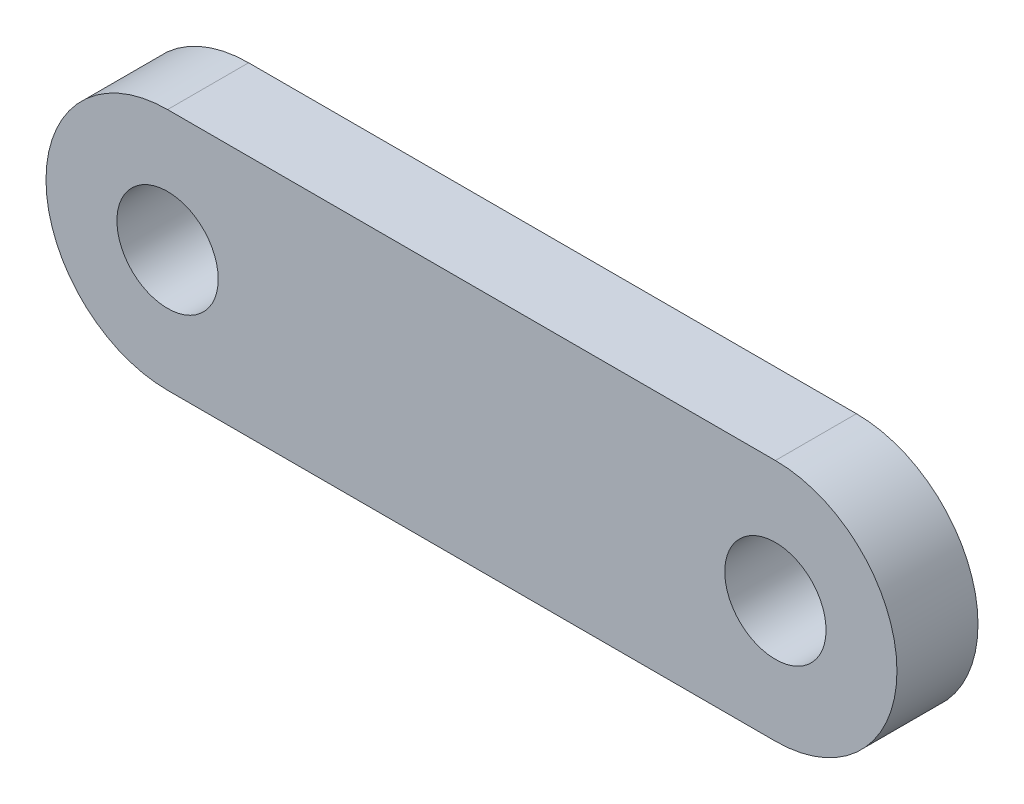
ISO-10303-21;
HEADER;
FILE_DESCRIPTION(('STEP AP214'),'2;1');
FILE_NAME('part.step','',(''),(''),'','','');
FILE_SCHEMA(('AUTOMOTIVE_DESIGN { 1 0 10303 214 1 1 1 1 }'));
ENDSEC;
DATA;
#1=APPLICATION_CONTEXT('core data for automotive mechanical design processes');
#2=APPLICATION_PROTOCOL_DEFINITION('international standard','automotive_design',2000,#1);
#3=PRODUCT_CONTEXT('',#1,'mechanical');
#4=PRODUCT('Part','Part','',(#3));
#5=PRODUCT_RELATED_PRODUCT_CATEGORY('part','',(#4));
#6=PRODUCT_DEFINITION_FORMATION('','',#4);
#7=PRODUCT_DEFINITION_CONTEXT('part definition',#1,'design');
#8=PRODUCT_DEFINITION('design','',#6,#7);
#9=PRODUCT_DEFINITION_SHAPE('','',#8);
#10=(LENGTH_UNIT() NAMED_UNIT(*) SI_UNIT(.MILLI.,.METRE.));
#11=(NAMED_UNIT(*) PLANE_ANGLE_UNIT() SI_UNIT($,.RADIAN.));
#12=(NAMED_UNIT(*) SI_UNIT($,.STERADIAN.) SOLID_ANGLE_UNIT());
#13=UNCERTAINTY_MEASURE_WITH_UNIT(LENGTH_MEASURE(1.E-05),#10,'distance_accuracy_value','');
#14=(GEOMETRIC_REPRESENTATION_CONTEXT(3) GLOBAL_UNCERTAINTY_ASSIGNED_CONTEXT((#13)) GLOBAL_UNIT_ASSIGNED_CONTEXT((#10,
#11,#12)) REPRESENTATION_CONTEXT('',''));
#15=CARTESIAN_POINT('',(0.,0.,0.));
#16=DIRECTION('',(0.,0.,1.));
#17=DIRECTION('',(1.,0.,0.));
#18=AXIS2_PLACEMENT_3D('',#15,#16,#17);
#19=CARTESIAN_POINT('',(-15.,0.,4.));
#20=DIRECTION('',(0.,0.,1.));
#21=DIRECTION('',(1.,0.,0.));
#22=AXIS2_PLACEMENT_3D('',#19,#20,#21);
#23=PLANE('',#22);
#24=CARTESIAN_POINT('',(-15.,0.,4.));
#25=DIRECTION('',(0.,0.,1.));
#26=DIRECTION('',(1.,0.,0.));
#27=AXIS2_PLACEMENT_3D('',#24,#25,#26);
#28=CIRCLE('',#27,2.5);
#29=CARTESIAN_POINT('',(-12.5,0.,4.));
#30=VERTEX_POINT('',#29);
#31=EDGE_CURVE('E102',#30,#30,#28,.T.);
#32=ORIENTED_EDGE('',*,*,#31,.F.);
#33=EDGE_LOOP('',(#32));
#34=FACE_BOUND('',#33,.T.);
#35=CARTESIAN_POINT('',(-15.,0.,4.));
#36=DIRECTION('',(0.,0.,1.));
#37=DIRECTION('',(1.,0.,0.));
#38=AXIS2_PLACEMENT_3D('',#35,#36,#37);
#39=CIRCLE('',#38,6.);
#40=CARTESIAN_POINT('',(-15.,6.,4.));
#41=VERTEX_POINT('',#40);
#42=CARTESIAN_POINT('',(-15.,-6.,4.));
#43=VERTEX_POINT('',#42);
#44=EDGE_CURVE('E87',#41,#43,#39,.T.);
#45=ORIENTED_EDGE('',*,*,#44,.T.);
#46=DIRECTION('',(1.,0.,0.));
#47=VECTOR('',#46,1.);
#48=CARTESIAN_POINT('',(-15.,-6.,4.));
#49=LINE('',#48,#47);
#50=CARTESIAN_POINT('',(15.,-6.,4.));
#51=VERTEX_POINT('',#50);
#52=EDGE_CURVE('E82',#43,#51,#49,.T.);
#53=ORIENTED_EDGE('',*,*,#52,.T.);
#54=CARTESIAN_POINT('',(15.,0.,4.));
#55=DIRECTION('',(0.,0.,1.));
#56=DIRECTION('',(1.,0.,0.));
#57=AXIS2_PLACEMENT_3D('',#54,#55,#56);
#58=CIRCLE('',#57,6.);
#59=CARTESIAN_POINT('',(15.,6.00000000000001,4.));
#60=VERTEX_POINT('',#59);
#61=EDGE_CURVE('E85',#51,#60,#58,.T.);
#62=ORIENTED_EDGE('',*,*,#61,.T.);
#63=DIRECTION('',(-1.,0.,0.));
#64=VECTOR('',#63,1.);
#65=CARTESIAN_POINT('',(-15.,6.,4.));
#66=LINE('',#65,#64);
#67=EDGE_CURVE('E52',#60,#41,#66,.T.);
#68=ORIENTED_EDGE('',*,*,#67,.T.);
#69=EDGE_LOOP('',(#45,#53,#62,#68));
#70=FACE_BOUND('',#69,.T.);
#71=CARTESIAN_POINT('',(15.,0.,4.));
#72=DIRECTION('',(0.,0.,1.));
#73=DIRECTION('',(1.,0.,0.));
#74=AXIS2_PLACEMENT_3D('',#71,#72,#73);
#75=CIRCLE('',#74,2.5);
#76=CARTESIAN_POINT('',(17.5,0.,4.));
#77=VERTEX_POINT('',#76);
#78=EDGE_CURVE('E117',#77,#77,#75,.T.);
#79=ORIENTED_EDGE('',*,*,#78,.F.);
#80=EDGE_LOOP('',(#79));
#81=FACE_BOUND('',#80,.T.);
#82=ADVANCED_FACE('F35',(#34,#70,#81),#23,.T.);
#83=CARTESIAN_POINT('',(-15.,0.,0.));
#84=DIRECTION('',(0.,0.,1.));
#85=DIRECTION('',(1.,0.,0.));
#86=AXIS2_PLACEMENT_3D('',#83,#84,#85);
#87=PLANE('',#86);
#88=CARTESIAN_POINT('',(-15.,0.,0.));
#89=DIRECTION('',(0.,0.,1.));
#90=DIRECTION('',(1.,0.,0.));
#91=AXIS2_PLACEMENT_3D('',#88,#89,#90);
#92=CIRCLE('',#91,2.5);
#93=CARTESIAN_POINT('',(-12.5,0.,0.));
#94=VERTEX_POINT('',#93);
#95=EDGE_CURVE('E114',#94,#94,#92,.T.);
#96=ORIENTED_EDGE('',*,*,#95,.T.);
#97=EDGE_LOOP('',(#96));
#98=FACE_BOUND('',#97,.T.);
#99=CARTESIAN_POINT('',(-15.,0.,0.));
#100=DIRECTION('',(0.,0.,1.));
#101=DIRECTION('',(1.,0.,0.));
#102=AXIS2_PLACEMENT_3D('',#99,#100,#101);
#103=CIRCLE('',#102,6.);
#104=CARTESIAN_POINT('',(-15.,6.,0.));
#105=VERTEX_POINT('',#104);
#106=CARTESIAN_POINT('',(-15.,-6.,0.));
#107=VERTEX_POINT('',#106);
#108=EDGE_CURVE('E99',#105,#107,#103,.T.);
#109=ORIENTED_EDGE('',*,*,#108,.F.);
#110=DIRECTION('',(-1.,0.,0.));
#111=VECTOR('',#110,1.);
#112=CARTESIAN_POINT('',(-15.,6.,0.));
#113=LINE('',#112,#111);
#114=CARTESIAN_POINT('',(15.,6.00000000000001,0.));
#115=VERTEX_POINT('',#114);
#116=EDGE_CURVE('E75',#115,#105,#113,.T.);
#117=ORIENTED_EDGE('',*,*,#116,.F.);
#118=CARTESIAN_POINT('',(15.,0.,0.));
#119=DIRECTION('',(0.,0.,1.));
#120=DIRECTION('',(1.,0.,0.));
#121=AXIS2_PLACEMENT_3D('',#118,#119,#120);
#122=CIRCLE('',#121,6.);
#123=CARTESIAN_POINT('',(15.,-6.,0.));
#124=VERTEX_POINT('',#123);
#125=EDGE_CURVE('E69',#124,#115,#122,.T.);
#126=ORIENTED_EDGE('',*,*,#125,.F.);
#127=DIRECTION('',(1.,0.,0.));
#128=VECTOR('',#127,1.);
#129=CARTESIAN_POINT('',(-15.,-6.,0.));
#130=LINE('',#129,#128);
#131=EDGE_CURVE('E91',#107,#124,#130,.T.);
#132=ORIENTED_EDGE('',*,*,#131,.F.);
#133=EDGE_LOOP('',(#109,#117,#126,#132));
#134=FACE_BOUND('',#133,.T.);
#135=CARTESIAN_POINT('',(15.,0.,0.));
#136=DIRECTION('',(0.,0.,1.));
#137=DIRECTION('',(1.,0.,0.));
#138=AXIS2_PLACEMENT_3D('',#135,#136,#137);
#139=CIRCLE('',#138,2.5);
#140=CARTESIAN_POINT('',(17.5,0.,0.));
#141=VERTEX_POINT('',#140);
#142=EDGE_CURVE('E120',#141,#141,#139,.T.);
#143=ORIENTED_EDGE('',*,*,#142,.T.);
#144=EDGE_LOOP('',(#143));
#145=FACE_BOUND('',#144,.T.);
#146=ADVANCED_FACE('F110',(#98,#134,#145),#87,.F.);
#147=CARTESIAN_POINT('',(-15.,0.,4.));
#148=DIRECTION('',(0.,0.,-1.));
#149=DIRECTION('',(-1.,0.,0.));
#150=AXIS2_PLACEMENT_3D('',#147,#148,#149);
#151=CYLINDRICAL_SURFACE('',#150,6.);
#152=ORIENTED_EDGE('',*,*,#108,.T.);
#153=DIRECTION('',(0.,0.,-1.));
#154=VECTOR('',#153,1.);
#155=CARTESIAN_POINT('',(-15.,-6.,4.));
#156=LINE('',#155,#154);
#157=EDGE_CURVE('E11',#43,#107,#156,.T.);
#158=ORIENTED_EDGE('',*,*,#157,.F.);
#159=ORIENTED_EDGE('',*,*,#44,.F.);
#160=DIRECTION('',(0.,0.,-1.));
#161=VECTOR('',#160,1.);
#162=CARTESIAN_POINT('',(-15.,6.,4.));
#163=LINE('',#162,#161);
#164=EDGE_CURVE('E95',#41,#105,#163,.T.);
#165=ORIENTED_EDGE('',*,*,#164,.T.);
#166=EDGE_LOOP('',(#152,#158,#159,#165));
#167=FACE_BOUND('',#166,.T.);
#168=ADVANCED_FACE('F37',(#167),#151,.T.);
#169=CARTESIAN_POINT('',(-15.,-6.,4.));
#170=DIRECTION('',(0.,1.,0.));
#171=DIRECTION('',(-1.,0.,0.));
#172=AXIS2_PLACEMENT_3D('',#169,#170,#171);
#173=PLANE('',#172);
#174=ORIENTED_EDGE('',*,*,#131,.T.);
#175=DIRECTION('',(0.,0.,-1.));
#176=VECTOR('',#175,1.);
#177=CARTESIAN_POINT('',(15.,-6.,4.));
#178=LINE('',#177,#176);
#179=EDGE_CURVE('E44',#51,#124,#178,.T.);
#180=ORIENTED_EDGE('',*,*,#179,.F.);
#181=ORIENTED_EDGE('',*,*,#52,.F.);
#182=ORIENTED_EDGE('',*,*,#157,.T.);
#183=EDGE_LOOP('',(#174,#180,#181,#182));
#184=FACE_BOUND('',#183,.T.);
#185=ADVANCED_FACE('F90',(#184),#173,.F.);
#186=CARTESIAN_POINT('',(15.,0.,4.));
#187=DIRECTION('',(0.,0.,-1.));
#188=DIRECTION('',(-1.,0.,0.));
#189=AXIS2_PLACEMENT_3D('',#186,#187,#188);
#190=CYLINDRICAL_SURFACE('',#189,6.);
#191=ORIENTED_EDGE('',*,*,#125,.T.);
#192=DIRECTION('',(0.,0.,-1.));
#193=VECTOR('',#192,1.);
#194=CARTESIAN_POINT('',(15.,6.00000000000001,4.));
#195=LINE('',#194,#193);
#196=EDGE_CURVE('E92',#60,#115,#195,.T.);
#197=ORIENTED_EDGE('',*,*,#196,.F.);
#198=ORIENTED_EDGE('',*,*,#61,.F.);
#199=ORIENTED_EDGE('',*,*,#179,.T.);
#200=EDGE_LOOP('',(#191,#197,#198,#199));
#201=FACE_BOUND('',#200,.T.);
#202=ADVANCED_FACE('F93',(#201),#190,.T.);
#203=CARTESIAN_POINT('',(-15.,6.,4.));
#204=DIRECTION('',(0.,-1.,0.));
#205=DIRECTION('',(1.,0.,0.));
#206=AXIS2_PLACEMENT_3D('',#203,#204,#205);
#207=PLANE('',#206);
#208=ORIENTED_EDGE('',*,*,#116,.T.);
#209=ORIENTED_EDGE('',*,*,#164,.F.);
#210=ORIENTED_EDGE('',*,*,#67,.F.);
#211=ORIENTED_EDGE('',*,*,#196,.T.);
#212=EDGE_LOOP('',(#208,#209,#210,#211));
#213=FACE_BOUND('',#212,.T.);
#214=ADVANCED_FACE('F107',(#213),#207,.F.);
#215=CARTESIAN_POINT('',(-15.,0.,4.));
#216=DIRECTION('',(0.,0.,-1.));
#217=DIRECTION('',(-1.,0.,0.));
#218=AXIS2_PLACEMENT_3D('',#215,#216,#217);
#219=CYLINDRICAL_SURFACE('',#218,2.5);
#220=ORIENTED_EDGE('',*,*,#31,.T.);
#221=EDGE_LOOP('',(#220));
#222=FACE_BOUND('',#221,.T.);
#223=ORIENTED_EDGE('',*,*,#95,.F.);
#224=EDGE_LOOP('',(#223));
#225=FACE_BOUND('',#224,.T.);
#226=ADVANCED_FACE('F138',(#222,#225),#219,.F.);
#227=CARTESIAN_POINT('',(15.,0.,4.));
#228=DIRECTION('',(0.,0.,-1.));
#229=DIRECTION('',(-1.,0.,0.));
#230=AXIS2_PLACEMENT_3D('',#227,#228,#229);
#231=CYLINDRICAL_SURFACE('',#230,2.5);
#232=ORIENTED_EDGE('',*,*,#78,.T.);
#233=EDGE_LOOP('',(#232));
#234=FACE_BOUND('',#233,.T.);
#235=ORIENTED_EDGE('',*,*,#142,.F.);
#236=EDGE_LOOP('',(#235));
#237=FACE_BOUND('',#236,.T.);
#238=ADVANCED_FACE('F126',(#234,#237),#231,.F.);
#239=CLOSED_SHELL('',(#82,#146,#168,#185,#202,#214,#226,#238));
#240=MANIFOLD_SOLID_BREP('B2',#239);
#241=ADVANCED_BREP_SHAPE_REPRESENTATION('',(#18,#240),#14);
#242=SHAPE_DEFINITION_REPRESENTATION(#9,#241);
ENDSEC;
END-ISO-10303-21;
